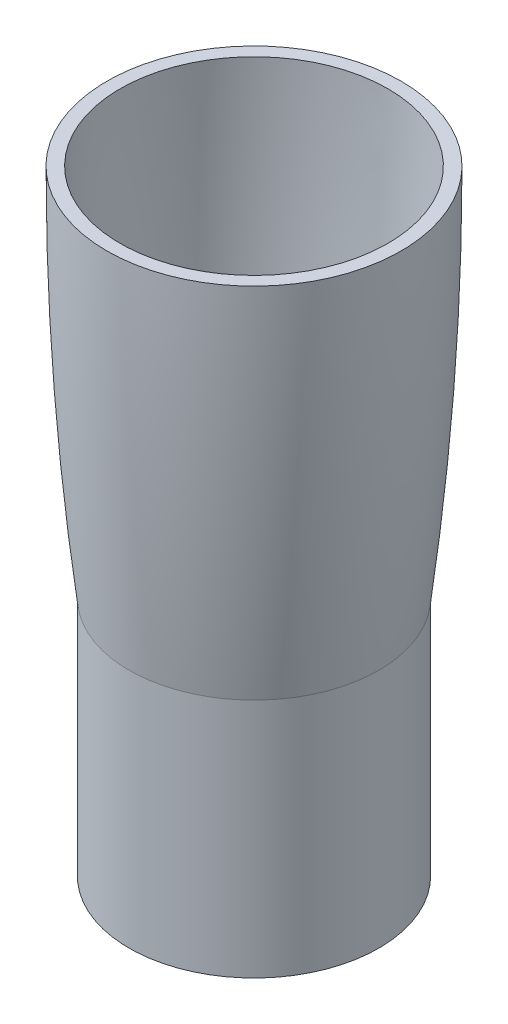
from build123d import *


with BuildPart() as part:
    # Sketch1 → Revolve1 (revolve)
    with BuildSketch(Plane.XY, mode=Mode.PRIVATE) as revolve1_sk:
        with BuildLine():
            Line((33.275650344, 152.756378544), (36.541649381, 152.756378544))
            ThreePointArc((36.541649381, 152.756378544), (35.162329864, 106.189181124), (31.029206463, 59.785262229))
            Line((31.029206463, 59.785262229), (31.029206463, 0))
            Line((31.029206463, 0), (27.763206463, 0))
            Line((27.763206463, 0), (27.763206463, 59.979103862))
            ThreePointArc((27.763206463, 59.979103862), (31.896325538, 106.285931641), (33.275650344, 152.756378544))
        make_face()
    revolve(revolve1_sk.sketch.rotate(Axis((0, 0, 0), (0, 1, 0)), 90), axis=Axis((0, 0, 0), (0, 1, 0)))


solid = part.part
